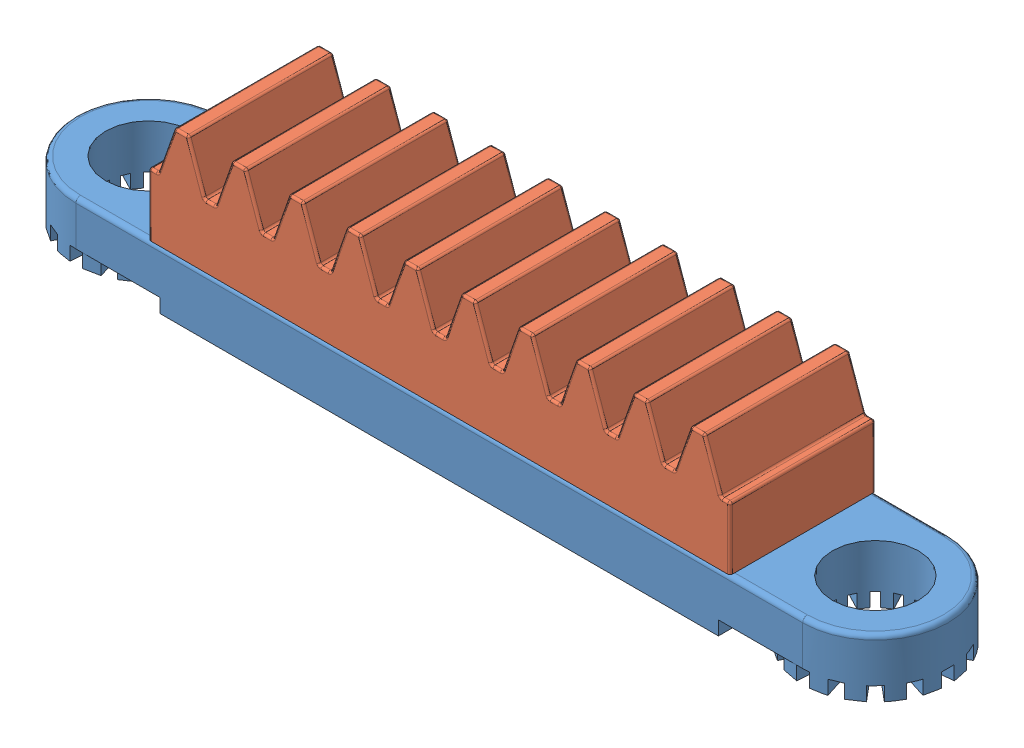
SolidWorks assembly Assem1.sldasm, configuration Default (file format 4400). Lengths in mm.
Overall size (47.62 9.14 7.94).
2 component instances, 2 part files, 3 mates.
Components (placement in the parent):
- 6x1 open end-1: 6x1 open end.SLDPRT [White] at (-5.398 0.3784 0.8657) size (47.62 5.08 7.94)
- Rack-1: Rack.sldprt [Default] at (-5.398 3.5534 0.8657) size (31.75 5.97 7.94)
Mates (geometry in assembly coordinates):
- Coincident1: coincident: plane of 6x1 open end-1 through (10.477 3.5534 4.8344) normal (0 0 1); plane of Rack-1 through (-21.273 3.5534 4.8344) normal (0 0 1)
- Concentric1: concentric: cylinder of 6x1 open end-1 through (2.5395 -3.2137 0.8657) axis (0 1 0) radius 1.27; cylinder of Rack-1 through (2.5395 9.5234 0.8657) axis (0 -1 0) radius 1.27
- Coincident2: coincident anti-aligned: plane of 6x1 open end-1 through (-21.273 3.5534 4.8344) normal (0 1 0); plane of Rack-1 through (10.477 3.5534 4.8344) normal (0 -1 0)
